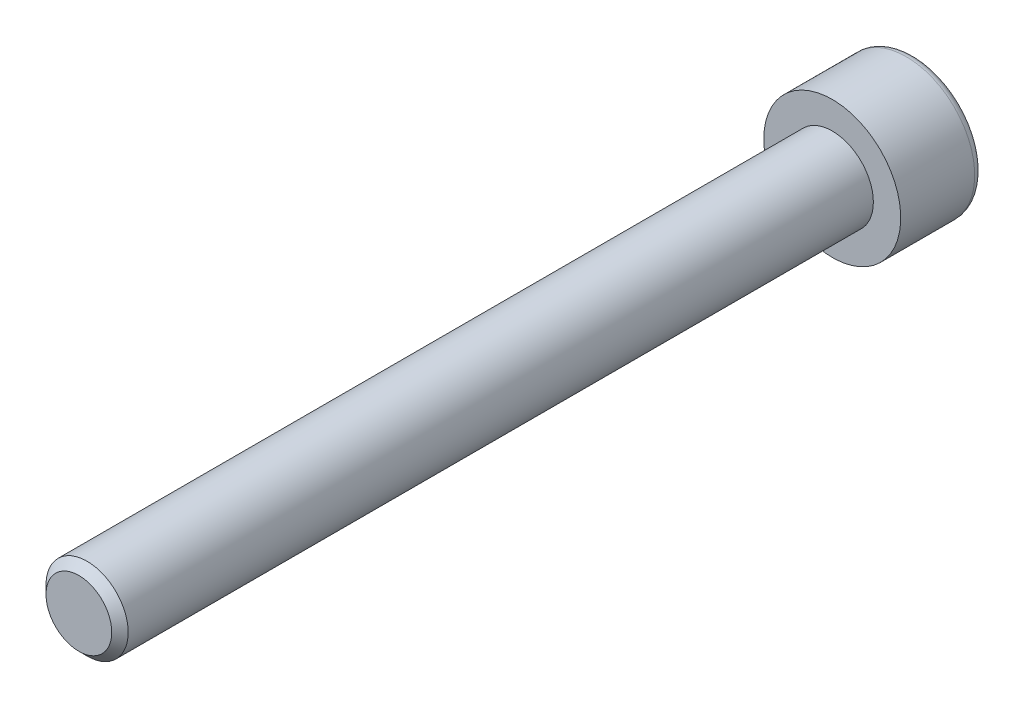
from build123d import *

# Parameters (mm, degrees)
ENLEV_MAT_EXTRU1_DEPTH = 3
ESQUISSE3_W            = 3
ESQUISSE3_H            = 55
CHANFREIN1_SIZE        = 0.6


with BuildPart() as part:
    # Esquisse1 → Base-R_volution (revolve)
    with BuildSketch(Plane(origin=(0, 0, 0), x_dir=(1, 0, 0), z_dir=(0, 1, 0)), mode=Mode.PRIVATE) as base_r_volution_sk:
        with BuildLine():
            Line((0, 0), (5, 0))
            Line((5, 0), (5, 5.4))
            ThreePointArc((5, 5.4), (4.824264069, 5.824264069), (4.4, 6))
            Line((4.4, 6), (0, 6))
            Line((0, 6), (0, 0))
        make_face()
    revolve(base_r_volution_sk.sketch.rotate(Axis((0, 0, 0), (0, 0, -1)), 180), axis=Axis((0, 0, 0), (0, 0, -1)))

    # Esquisse2 → enlev-mat-Extru1 (cut)
    with BuildSketch(Plane.XY.offset(-6)):
        Polygon((2.5, -1.443375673), (2.5, 1.443375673), (0, 2.886751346), (-2.5, 1.443375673), (-2.5, -1.443375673), (0, -2.886751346), align=None)
    extrude(amount=ENLEV_MAT_EXTRU1_DEPTH, mode=Mode.SUBTRACT)

    # Esquisse3 → Boss.-R_vol.1 (revolve)
    with BuildSketch(Plane(origin=(0, 0, 0), x_dir=(1, 0, 0), z_dir=(0, 1, 0))):
        with Locations((1.5, -27.5)):
            Rectangle(ESQUISSE3_W, ESQUISSE3_H)
    revolve(axis=Axis((0, 0, 0), (0, 0, 1)))

    # Chanfrein1
    chanfrein1_edges = [part.edges().sort_by_distance(p)[0] for p in [
        (-3, 0, 55),
    ]]
    chamfer(chanfrein1_edges, length=CHANFREIN1_SIZE)


solid = part.part
